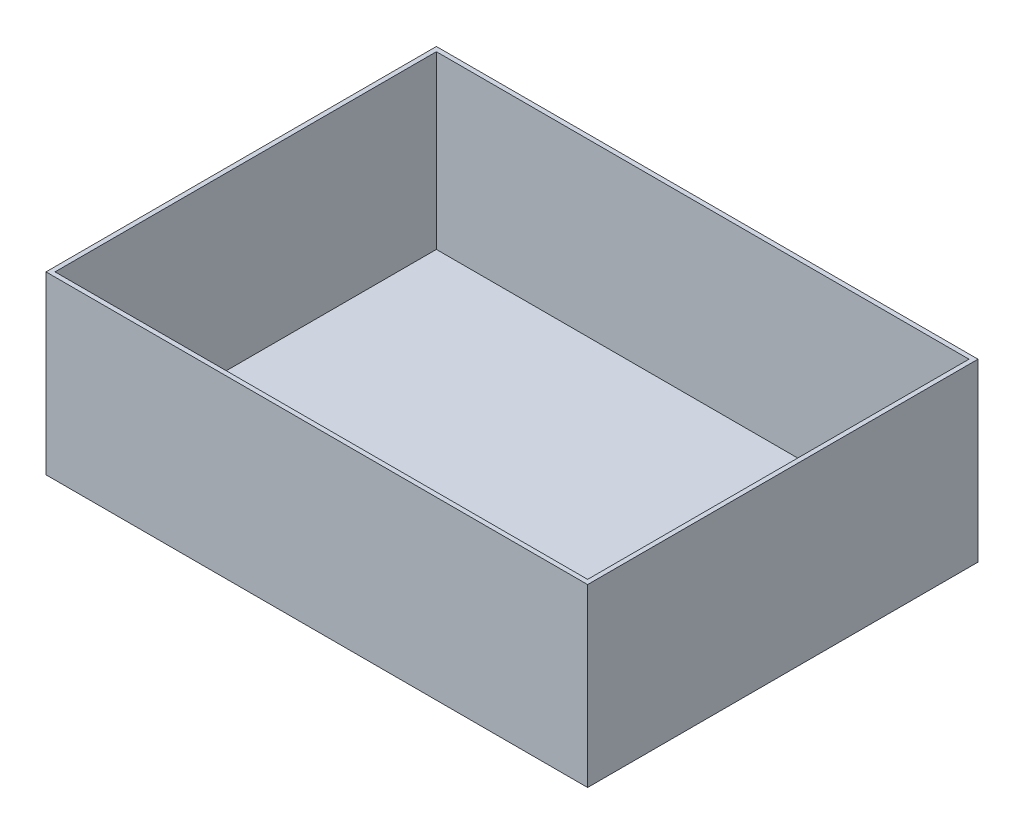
from build123d import *

# Parameters (mm, degrees)
SKETCH1_W      = 152.617490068
SKETCH1_H      = 110.005019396
EXTRUDE1_DEPTH = 49.53
SHELL1_T       = -1.27


with BuildPart() as part:
    # Sketch1 → Extrude1 (new body)
    with BuildSketch(Plane(origin=(0, 0, 0), x_dir=(1, 0, 0), z_dir=(0, 1, 0))):
        Rectangle(SKETCH1_W, SKETCH1_H)
    extrude(amount=EXTRUDE1_DEPTH)

    # Shell1
    shell1_openings = [part.faces().sort_by_distance(p)[0] for p in [
        (0, 49.53, 0),
    ]]
    offset(amount=SHELL1_T, openings=shell1_openings, kind=Kind.INTERSECTION)


solid = part.part
